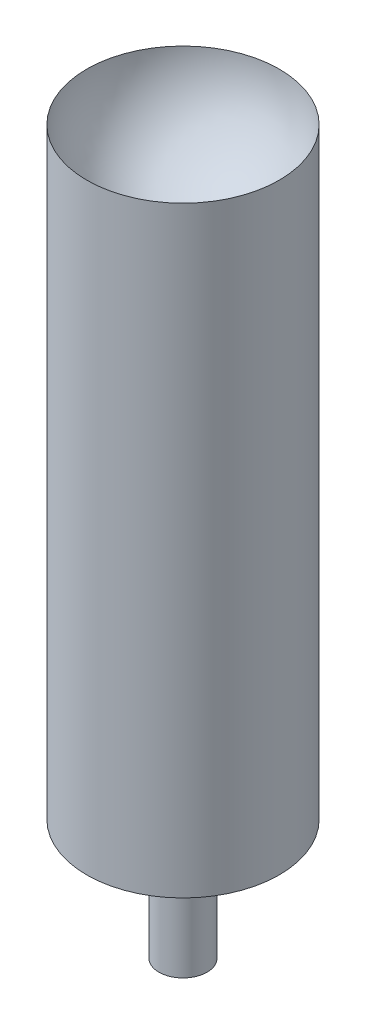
from build123d import *


with BuildPart() as part:
    # Sketch1 → Revolve1 (revolve)
    with BuildSketch(Plane.XY, mode=Mode.PRIVATE) as revolve1_sk:
        with BuildLine():
            Line((0, 0), (2, 0))
            Line((2, 0), (2, 10))
            Line((2, 10), (8, 10))
            Line((8, 10), (8, 60))
            ThreePointArc((8, 60), (5.656854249, 54.343145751), (0, 52))
            Line((0, 52), (0, 0))
        make_face()
    revolve(revolve1_sk.sketch.rotate(Axis((0, 0, 0), (0, 1, 0)), 90), axis=Axis((0, 0, 0), (0, 1, 0)))


solid = part.part
